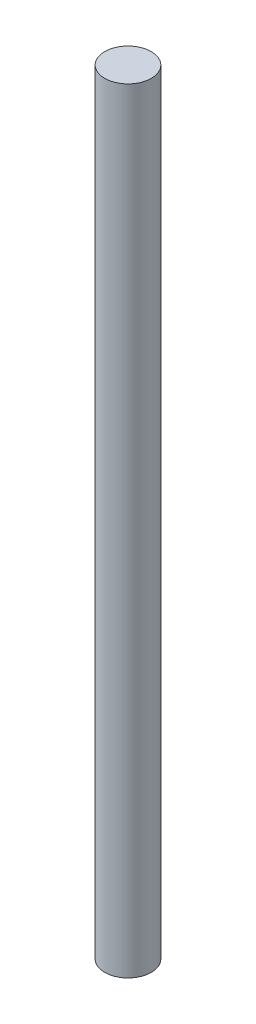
ISO-10303-21;
HEADER;
FILE_DESCRIPTION(('STEP AP214'),'2;1');
FILE_NAME('part.step','',(''),(''),'','','');
FILE_SCHEMA(('AUTOMOTIVE_DESIGN { 1 0 10303 214 1 1 1 1 }'));
ENDSEC;
DATA;
#1=APPLICATION_CONTEXT('core data for automotive mechanical design processes');
#2=APPLICATION_PROTOCOL_DEFINITION('international standard','automotive_design',2000,#1);
#3=PRODUCT_CONTEXT('',#1,'mechanical');
#4=PRODUCT('Part','Part','',(#3));
#5=PRODUCT_RELATED_PRODUCT_CATEGORY('part','',(#4));
#6=PRODUCT_DEFINITION_FORMATION('','',#4);
#7=PRODUCT_DEFINITION_CONTEXT('part definition',#1,'design');
#8=PRODUCT_DEFINITION('design','',#6,#7);
#9=PRODUCT_DEFINITION_SHAPE('','',#8);
#10=(LENGTH_UNIT() NAMED_UNIT(*) SI_UNIT(.MILLI.,.METRE.));
#11=(NAMED_UNIT(*) PLANE_ANGLE_UNIT() SI_UNIT($,.RADIAN.));
#12=(NAMED_UNIT(*) SI_UNIT($,.STERADIAN.) SOLID_ANGLE_UNIT());
#13=UNCERTAINTY_MEASURE_WITH_UNIT(LENGTH_MEASURE(1.E-05),#10,'distance_accuracy_value','');
#14=(GEOMETRIC_REPRESENTATION_CONTEXT(3) GLOBAL_UNCERTAINTY_ASSIGNED_CONTEXT((#13)) GLOBAL_UNIT_ASSIGNED_CONTEXT((#10,
#11,#12)) REPRESENTATION_CONTEXT('',''));
#15=CARTESIAN_POINT('',(0.,0.,0.));
#16=DIRECTION('',(0.,0.,1.));
#17=DIRECTION('',(1.,0.,0.));
#18=AXIS2_PLACEMENT_3D('',#15,#16,#17);
#19=CARTESIAN_POINT('',(0.,200.,0.));
#20=DIRECTION('',(0.,-1.,0.));
#21=DIRECTION('',(0.,0.,-1.));
#22=AXIS2_PLACEMENT_3D('',#19,#20,#21);
#23=CYLINDRICAL_SURFACE('',#22,6.);
#24=CARTESIAN_POINT('',(0.,200.,0.));
#25=DIRECTION('',(0.,1.,0.));
#26=DIRECTION('',(0.,0.,1.));
#27=AXIS2_PLACEMENT_3D('',#24,#25,#26);
#28=CIRCLE('',#27,6.);
#29=CARTESIAN_POINT('',(0.,200.,6.));
#30=VERTEX_POINT('',#29);
#31=EDGE_CURVE('E10',#30,#30,#28,.T.);
#32=ORIENTED_EDGE('',*,*,#31,.F.);
#33=EDGE_LOOP('',(#32));
#34=FACE_BOUND('',#33,.T.);
#35=CARTESIAN_POINT('',(0.,0.,0.));
#36=DIRECTION('',(0.,1.,0.));
#37=DIRECTION('',(0.,0.,1.));
#38=AXIS2_PLACEMENT_3D('',#35,#36,#37);
#39=CIRCLE('',#38,6.);
#40=CARTESIAN_POINT('',(0.,0.,6.));
#41=VERTEX_POINT('',#40);
#42=EDGE_CURVE('E46',#41,#41,#39,.T.);
#43=ORIENTED_EDGE('',*,*,#42,.T.);
#44=EDGE_LOOP('',(#43));
#45=FACE_BOUND('',#44,.T.);
#46=ADVANCED_FACE('F43',(#34,#45),#23,.T.);
#47=CARTESIAN_POINT('',(0.,200.,0.));
#48=DIRECTION('',(0.,1.,0.));
#49=DIRECTION('',(0.,0.,1.));
#50=AXIS2_PLACEMENT_3D('',#47,#48,#49);
#51=PLANE('',#50);
#52=ORIENTED_EDGE('',*,*,#31,.T.);
#53=EDGE_LOOP('',(#52));
#54=FACE_BOUND('',#53,.T.);
#55=ADVANCED_FACE('F60',(#54),#51,.T.);
#56=CARTESIAN_POINT('',(0.,0.,0.));
#57=DIRECTION('',(0.,1.,0.));
#58=DIRECTION('',(0.,0.,1.));
#59=AXIS2_PLACEMENT_3D('',#56,#57,#58);
#60=PLANE('',#59);
#61=ORIENTED_EDGE('',*,*,#42,.F.);
#62=EDGE_LOOP('',(#61));
#63=FACE_BOUND('',#62,.T.);
#64=ADVANCED_FACE('F58',(#63),#60,.F.);
#65=CLOSED_SHELL('',(#46,#55,#64));
#66=MANIFOLD_SOLID_BREP('B2',#65);
#67=ADVANCED_BREP_SHAPE_REPRESENTATION('',(#18,#66),#14);
#68=SHAPE_DEFINITION_REPRESENTATION(#9,#67);
ENDSEC;
END-ISO-10303-21;
